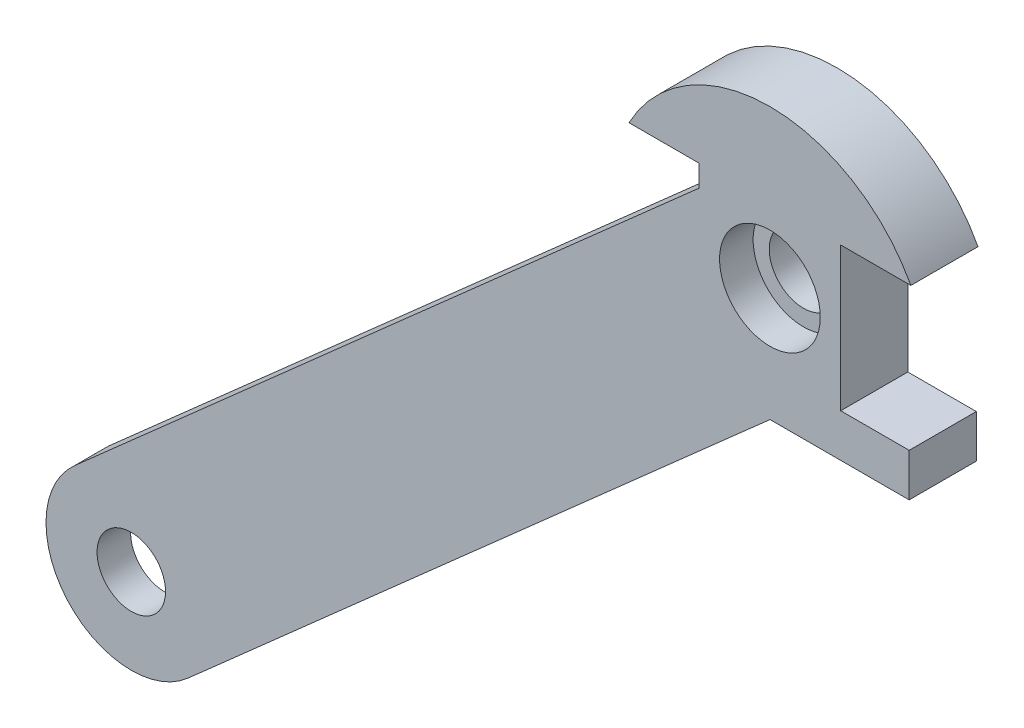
from build123d import *

# Parameters (mm, degrees)
BOSS_EXTRUDE2_DEPTH     = 10
CUT_EXTRUDE2_DEPTH      = 32.853215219
CUT_EXTRUDE2_DEPTH_BACK = 32.853215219
SKETCH4_R               = 5.1
BOSS_EXTRUDE4_DEPTH     = 5
SKETCH9_R               = 5
SKETCH9_R_2             = 5.1
CUT_EXTRUDE5_DEPTH      = 5
SKETCH10_R              = 7.5
CUT_EXTRUDE6_DEPTH      = 5


with BuildPart() as part:
    # Sketch3 → Boss-Extrude2 (new body)
    with BuildSketch(Plane.XY):
        with BuildLine():
            Line((-20.74, -16.94245), (20.74, -16.94245))
            Line((20.74, -16.94245), (20.74, -10.5429))
            Line((20.74, -10.5429), (10.54169, -10.5429))
            Line((10.54169, -10.5429), (10.54169, 10.84581))
            Line((10.54169, 10.84581), (20.99169, 10.84581))
            ThreePointArc((20.99169, 10.84581), (0, 23.430242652), (-20.99169, 10.84581))
            Line((-20.99169, 10.84581), (-10.54169, 10.84581))
            Line((-10.54169, 10.84581), (-10.54169, -10.5429))
            Line((-10.54169, -10.5429), (-20.74, -10.5429))
            Line((-20.74, -10.5429), (-20.74, -16.94245))
        make_face()
    extrude(amount=BOSS_EXTRUDE2_DEPTH)

    # Sketch4 → Cut-Extrude2 (cut, two sides: drawn at the far end of the back side and taken through both)
    with BuildSketch(Plane.XY.offset(5).offset(-CUT_EXTRUDE2_DEPTH_BACK)):
        Circle(SKETCH4_R)
    extrude(amount=CUT_EXTRUDE2_DEPTH + CUT_EXTRUDE2_DEPTH_BACK, mode=Mode.SUBTRACT)

    # Sketch8 → Boss-Extrude4 (add)
    with BuildSketch(Plane.XY.offset(5)):
        with BuildLine():
            Line((-7.805332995, 10.051368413), (-103.532651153, -74.641008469))
            ThreePointArc((-103.532651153, -74.641008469), (-104.629114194, -92.568020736), (-86.702101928, -93.664483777))
            Line((-86.702101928, -93.664483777), (9.02521623, -8.972106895))
            ThreePointArc((9.02521623, -8.972106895), (5.664985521, 5.011955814), (-7.805332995, 10.051368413))
        make_face()
    extrude(amount=BOSS_EXTRUDE4_DEPTH)

    # Sketch9 → Cut-Extrude5 (cut)
    with BuildSketch(Plane.XY.offset(5)):
        Circle(SKETCH9_R)
        with Locations((-95.11737654, -84.152746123)):
            Circle(SKETCH9_R_2)
    extrude(amount=CUT_EXTRUDE5_DEPTH, mode=Mode.SUBTRACT)

    # Sketch10 → Cut-Extrude6 (cut)
    with BuildSketch(Plane.XY.offset(5)):
        Circle(SKETCH10_R)
    extrude(amount=CUT_EXTRUDE6_DEPTH, mode=Mode.SUBTRACT)


solid = part.part
